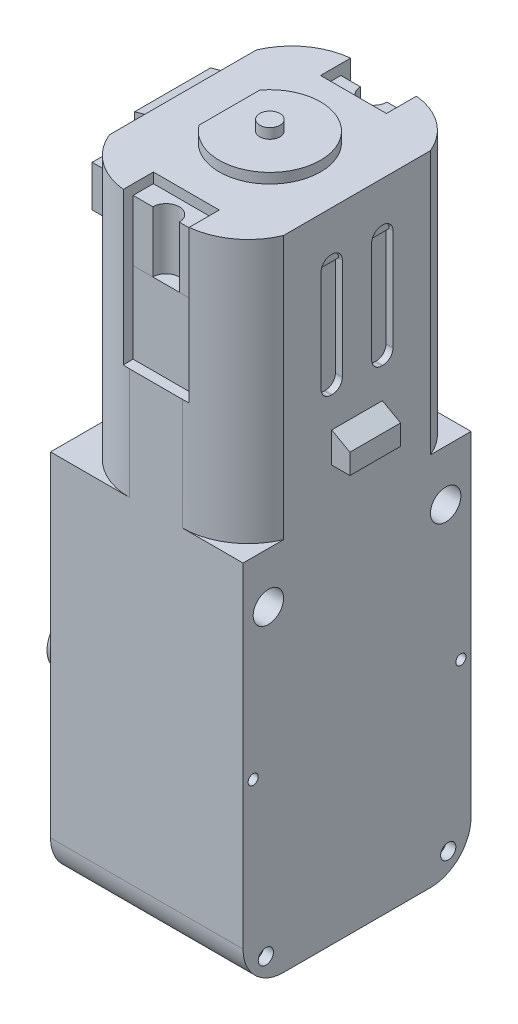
from build123d import *

# Parameters (mm, degrees)
SALIENTE_EXTRUIR2_DEPTH       = 9.5
SALIENTE_EXTRUIR2_DEPTH_BACK  = 9.5
SALIENTE_EXTRUIR4_DEPTH       = 1.3
SALIENTE_EXTRUIR4_DEPTH_BACK  = 1.3
CROQUIS2_W                    = 4.5
CROQUIS2_H                    = 5
CROQUIS2_R                    = 1.5
CROQUIS3_R                    = 2.5
CORTAR_EXTRUIR1_DEPTH         = 5
CROQUIS5_R                    = 0.75
CROQUIS5_R_2                  = 0.5
CORTAR_EXTRUIR2_DEPTH         = 1
CORTAR_EXTRUIR3_START         = -1
CROQUIS4_R                    = 0.5
CROQUIS4_R_2                  = 0.75
CORTAR_EXTRUIR3_DEPTH         = 1
CROQUIS6_R                    = 2
SALIENTE_EXTRUIR6_DEPTH       = 2
CROQUIS7_R                    = 1.5
CORTAR_EXTRUIR4_DEPTH         = 37.97672376
SALIENTE_EXTRUIR7_DEPTH       = 26
CROQUIS9_W                    = 27.483780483
CROQUIS9_H                    = 31.518144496
CORTAR_EXTRUIR5_DEPTH         = 60.879863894
CORTAR_EXTRUIR7_DEPTH         = 60.879863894
CORTAR_EXTRUIR7_DEPTH_BACK    = 60.879863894
CROQUIS11_W                   = 28.397068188
CROQUIS11_H                   = 15.296763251
CROQUIS12_W                   = 22.5
CROQUIS12_H                   = 4.565295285
CROQUIS12_R                   = 1.5
CORTAR_EXTRUIR8_DEPTH         = 60.879863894
CROQUIS14_W                   = 19
CROQUIS14_H                   = 22.5
SALIENTE_EXTRUIR9_DEPTH       = 30
CROQUIS15_R                   = 1.5
CORTAR_EXTRUIR9_DEPTH         = 60.879863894
CROQUIS16_R                   = 2
SALIENTE_EXTRUIR10_DEPTH      = 2
CROQUIS17_R                   = 0.5
CROQUIS17_R_2                 = 0.75
CORTAR_EXTRUIR10_DEPTH        = 60.879863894
CROQUIS20_W                   = 0.773109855
CROQUIS20_H                   = 0.470542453
SALIENTE_EXTRUIR12_DEPTH      = 24
CROQUIS21_W                   = 16.85701041
CROQUIS21_H                   = 22.5
SALIENTE_EXTRUIR13_DEPTH      = 24
CORTAR_EXTRUIR11_DEPTH        = 60.879863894
CORTAR_EXTRUIR12_DEPTH        = 5
CROQUIS23_R                   = 2.75
CROQUIS23_R_2                 = 2.6
SALIENTE_EXTRUIR14_DEPTH      = 0.5
SALIENTE_EXTRUIR14_DRAFT      = 8
CROQUIS24_W                   = 2.5
CROQUIS24_H                   = 5
SALIENTE_EXTRUIR15_DEPTH      = 4.7
CROQUIS25_R                   = 1.4
CORTAR_EXTRUIR13_DEPTH        = 4.7
SALIENTE_EXTRUIR17_DEPTH      = 2
SALIENTE_EXTRUIR17_DEPTH_BACK = 19
CROQUIS26_W                   = 3
CROQUIS26_H                   = 5
CORTAR_EXTRUIR14_DEPTH        = 58.938312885
CORTAR_EXTRUIR14_DEPTH_BACK   = 58.938312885
CORTAR_EXTRUIR15_DEPTH        = 60.879863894
CORTAR_EXTRUIR16_START        = -7
CORTAR_EXTRUIR16_DEPTH        = 7
SALIENTE_EXTRUIR18_DEPTH      = 3.75
SALIENTE_EXTRUIR18_DEPTH_BACK = 3.75
CROQUIS30_W                   = 7.5
CROQUIS30_H                   = 1
CORTAR_EXTRUIR17_DEPTH        = 58.938312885
CORTAR_EXTRUIR17_DEPTH_BACK   = 58.938312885
CROQUIS31_W                   = 5.5
CROQUIS31_H                   = 1.5
CORTAR_EXTRUIR18_DEPTH        = 58.938312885
CORTAR_EXTRUIR18_DEPTH_BACK   = 58.938312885
CORTAR_EXTRUIR22_DEPTH        = 59.781677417
CORTAR_EXTRUIR22_DEPTH_BACK   = 59.781677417
CORTAR_EXTRUIR23_START        = -15
CORTAR_EXTRUIR23_DEPTH        = 15
CORTAR_EXTRUIR24_DEPTH        = 5
CROQUIS37_W                   = 15.777972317
CROQUIS37_H                   = 14.808381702
SALIENTE_EXTRUIR19_DEPTH      = 11
CROQUIS38_W                   = 18.88083152
CROQUIS38_H                   = 4.081408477
SALIENTE_EXTRUIR21_DEPTH      = 1
CROQUIS39_W                   = 9.12350037
CROQUIS39_H                   = 4.081408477
SALIENTE_EXTRUIR23_DEPTH      = 0.6
CROQUIS40_W                   = 6.5
CROQUIS40_H                   = 2
SALIENTE_EXTRUIR24_DEPTH      = 8
SALIENTE_EXTRUIR24_2_DEPTH    = 8
CROQUIS41_R                   = 1
SALIENTE_EXTRUIR26_DEPTH      = 7
SALIENTE_EXTRUIR27_DEPTH      = 6
SALIENTE_EXTRUIR27_2_DEPTH    = 6
SALIENTE_EXTRUIR28_DEPTH      = 6
CROQUIS44_W                   = 5.21443522
CROQUIS44_H                   = 9.574781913
SALIENTE_EXTRUIR29_DEPTH      = 2
CROQUIS46_R                   = 0.697640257
SALIENTE_EXTRUIR32_DEPTH      = 0.4
SALIENTE_EXTRUIR32_2_DEPTH    = 0.4
CROQUIS47_R                   = 2.6
SALIENTE_EXTRUIR33_DEPTH      = 14
CORTAR_EXTRUIR25_DEPTH        = 8
CROQUIS49_R                   = 1
CORTAR_EXTRUIR26_DEPTH        = 8


with BuildPart() as part:
    # Croquis1 → Saliente-Extruir2 (new, two sides: drawn at the far end of the back side and taken through both)
    with BuildSketch(Plane.YZ.offset(-SALIENTE_EXTRUIR2_DEPTH_BACK)):
        with BuildLine():
            Line((-4.84, 11.25), (29.66, 11.25))
            Line((29.66, 11.25), (29.66, -11.25))
            Line((29.66, -11.25), (-4.84, -11.25))
            ThreePointArc((-4.84, -11.25), (-6.607766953, -10.517766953), (-7.34, -8.75))
            Line((-7.34, -8.75), (-7.34, 8.75))
            ThreePointArc((-7.34, 8.75), (-6.607766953, 10.517766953), (-4.84, 11.25))
        make_face()
    extrude(amount=SALIENTE_EXTRUIR2_DEPTH + SALIENTE_EXTRUIR2_DEPTH_BACK)

    # Croquis2 → Saliente-Extruir4 (add, two sides: drawn at the far end of the back side and taken through both)
    with BuildSketch(Plane.YZ.offset(-SALIENTE_EXTRUIR4_DEPTH_BACK)):
        with Locations((-9.59, 0)):
            Rectangle(CROQUIS2_W, CROQUIS2_H)
        with Locations(Location((-9.34, 0, 0), (0, 0, 270))):
            Circle(CROQUIS2_R, mode=Mode.SUBTRACT)
    extrude(amount=SALIENTE_EXTRUIR4_DEPTH + SALIENTE_EXTRUIR4_DEPTH_BACK)

    # Croquis3 → Cortar-Extruir1 (cut)
    with BuildSketch(Plane(origin=(-9.5, 0, 0), x_dir=(0, -1, 0), z_dir=(-1, 0, 0))):
        with Locations(Location((0, 0, 0), (0, 0, 90))):
            Circle(CROQUIS3_R)
    extrude(amount=-CORTAR_EXTRUIR1_DEPTH, mode=Mode.SUBTRACT)

    # Croquis5 → Cortar-Extruir2 (cut)
    with BuildSketch(Plane.YZ.offset(9.5)):
        with Locations(Location((-4.84, 8.75, 0), (0, 0, 270))):
            Circle(CROQUIS5_R)
        with Locations(Location((5.66, 9.75, 0), (0, 0, 270))):
            Circle(CROQUIS5_R_2)
        with Locations(Location((5.66, -9.75, 0), (0, 0, 270))):
            Circle(CROQUIS5_R_2)
        with Locations(Location((-4.84, -8.75, 0), (0, 0, 270))):
            Circle(CROQUIS5_R)
    extrude(amount=-CORTAR_EXTRUIR2_DEPTH, mode=Mode.SUBTRACT)

    # Croquis4 → Cortar-Extruir3 (cut)
    with BuildSketch(Plane.ZY.offset(9.5).offset(CORTAR_EXTRUIR3_START)):
        with Locations(Location((9.75, 5.66, 0), (0, 0, 180))):
            Circle(CROQUIS4_R)
        with Locations(Location((8.75, -4.84, 0), (0, 0, 180))):
            Circle(CROQUIS4_R_2)
        with Locations(Location((-8.75, -4.84, 0), (0, 0, 180))):
            Circle(CROQUIS4_R_2)
        with Locations(Location((-9.75, 5.66, 0), (0, 0, 180))):
            Circle(CROQUIS4_R)
    extrude(amount=CORTAR_EXTRUIR3_DEPTH, mode=Mode.SUBTRACT)

    # Croquis6 → Saliente-Extruir6 (add)
    with BuildSketch(Plane.ZY.offset(9.5)):
        with Locations(Location((0, 10.66, 0), (0, 0, 180))):
            Circle(CROQUIS6_R)
    extrude(amount=SALIENTE_EXTRUIR6_DEPTH)

    # Croquis7 → Cortar-Extruir4 (cut, through all)
    with BuildSketch(Plane.ZY.offset(9.5)):
        with Locations((-8.75, 19.66)):
            Circle(CROQUIS7_R)
        with Locations(Location((8.75, 19.66, 0), (0, 0, 180))):
            Circle(CROQUIS7_R)
    extrude(amount=-CORTAR_EXTRUIR4_DEPTH, mode=Mode.SUBTRACT)

    # Croquis8 → Saliente-Extruir7 (add)
    with BuildSketch(Plane(origin=(0, 29.66, 0), x_dir=(-1, 0, 0), z_dir=(0, 1, 0))):
        with BuildLine():
            Line((-3.5, 11.25), (1.7, 11.25))
            ThreePointArc((1.7, 11.25), (5.305551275, 10.158326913), (7.7, 7.25))
            Line((7.7, 7.25), (7.7, -7.25))
            ThreePointArc((7.7, -7.25), (5.305551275, -10.158326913), (1.7, -11.25))
            Line((1.7, -11.25), (-3.5, -11.25))
            ThreePointArc((-3.5, -11.25), (-7.105551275, -10.158326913), (-9.5, -7.25))
            Line((-9.5, -7.25), (-9.5, 7.25))
            ThreePointArc((-9.5, 7.25), (-7.105551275, 10.158326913), (-3.5, 11.25))
        make_face()
    extrude(amount=SALIENTE_EXTRUIR7_DEPTH)

    # Croquis9 → Cortar-Extruir5 (cut, through all)
    with BuildSketch(Plane(origin=(-9.5, 0, 0), x_dir=(0, -1, 0), z_dir=(-1, 0, 0))):
        with Locations((5.081890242, -0.401551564)):
            Rectangle(CROQUIS9_W, CROQUIS9_H)
    extrude(amount=-CORTAR_EXTRUIR5_DEPTH, mode=Mode.SUBTRACT)

    # Croquis11 → Cortar-Extruir7 (cut, two sides: drawn at the far end of the back side and taken through both)
    with BuildSketch(Plane.ZY.offset(9.5).offset(-CORTAR_EXTRUIR7_DEPTH_BACK)):
        with Locations((-0.835139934, 10.44632309)):
            Rectangle(CROQUIS11_W, CROQUIS11_H)
    extrude(amount=CORTAR_EXTRUIR7_DEPTH + CORTAR_EXTRUIR7_DEPTH_BACK, mode=Mode.SUBTRACT)

    # Croquis12 → Cortar-Extruir8 (cut, through all)
    # profile 1 of 2: a face of its own
    with BuildSketch(Plane.ZY.offset(9.5)):
        with Locations((0, 20.377352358)):
            Rectangle(CROQUIS12_W, CROQUIS12_H)
        with Locations((-8.75, 19.66)):
            Circle(CROQUIS12_R, mode=Mode.SUBTRACT)
        with Locations((8.75, 19.66)):
            Circle(CROQUIS12_R, mode=Mode.SUBTRACT)
    # profile 2 of 2: a face of its own
    with BuildSketch(Plane.ZY.offset(9.5)):
        Polygon((12.104698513, 22.66), (11.25, 22.66), (11.25, 18.094704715), (-11.25, 18.094704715), (-11.25, 15.490950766), (12.104698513, 15.490950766), align=None)
    extrude(amount=-CORTAR_EXTRUIR8_DEPTH, mode=Mode.SUBTRACT)

    # Croquis14 → Saliente-Extruir9 (add)
    with BuildSketch(Plane(origin=(0, 22.66, 0), x_dir=(-1, 0, 0), z_dir=(0, -1, 0))):
        Rectangle(CROQUIS14_W, CROQUIS14_H)
    extrude(amount=SALIENTE_EXTRUIR9_DEPTH)

    # Croquis15 → Cortar-Extruir9 (cut, through all)
    with BuildSketch(Plane.ZY.offset(9.5)):
        with Locations((8.75, 24.66)):
            Circle(CROQUIS15_R)
        with Locations((-8.75, 24.66)):
            Circle(CROQUIS15_R)
    extrude(amount=-CORTAR_EXTRUIR9_DEPTH, mode=Mode.SUBTRACT)

    # Croquis16 → Saliente-Extruir10 (add)
    with BuildSketch(Plane.ZY.offset(9.5)):
        with Locations(Location((0, 15.66, 0), (0, 0, 180))):
            Circle(CROQUIS16_R)
    extrude(amount=SALIENTE_EXTRUIR10_DEPTH)

    # Croquis17 → Cortar-Extruir10 (cut, through all)
    with BuildSketch(Plane.ZY.offset(9.5)):
        with Locations((10.25, 10.66)):
            Circle(CROQUIS17_R)
        with BuildLine():
            ThreePointArc((9.530330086, -5.620330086), (9.692909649, -5.377012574), (9.75, -5.09))
            ThreePointArc((9.75, -5.09), (9.287012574, -4.397090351), (8.469669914, -4.559669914))
            Line((8.469669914, -4.559669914), (9.530330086, -5.620330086))
        make_face()
        with BuildLine():
            Line((9.530330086, -5.620330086), (8.469669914, -4.559669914))
            ThreePointArc((8.469669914, -4.559669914), (8.469669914, -5.620330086), (9.530330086, -5.620330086))
        make_face()
        with BuildLine():
            ThreePointArc((9.530330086, -5.620330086), (9.692909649, -5.377012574), (9.75, -5.09))
            ThreePointArc((9.75, -5.09), (9.287012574, -4.397090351), (8.469669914, -4.559669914))
            Line((8.469669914, -4.559669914), (9.530330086, -5.620330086))
        make_face()
        with BuildLine():
            Line((9.530330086, -5.620330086), (8.469669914, -4.559669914))
            ThreePointArc((8.469669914, -4.559669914), (8.469669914, -5.620330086), (9.530330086, -5.620330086))
        make_face()
        with Locations((-10.25, 10.66)):
            Circle(CROQUIS17_R)
        with Locations(Location((-9, -5.09, 0), (0, 0, 180))):
            Circle(CROQUIS17_R_2)
    extrude(amount=-CORTAR_EXTRUIR10_DEPTH, mode=Mode.SUBTRACT)

    # Croquis20 → Saliente-Extruir12 (add)
    with BuildSketch(Plane.XZ.offset(7.34)):
        with Locations((2.429452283, 4.566914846)):
            Rectangle(CROQUIS20_W, CROQUIS20_H)
    extrude(amount=-SALIENTE_EXTRUIR12_DEPTH)

    # Croquis21 → Saliente-Extruir13 (add)
    with BuildSketch(Plane(origin=(0, -7.34, 0), x_dir=(-1, 0, 0), z_dir=(0, -1, 0))):
        with Locations((-0.10132468, 0)):
            Rectangle(CROQUIS21_W, CROQUIS21_H)
    extrude(amount=-SALIENTE_EXTRUIR13_DEPTH)

    # Croquis19 → Cortar-Extruir11 (cut, through all)
    with BuildSketch(Plane.ZY.offset(9.5)):
        with BuildLine():
            Line((7.25, -7.34), (11.25, -7.34))
            Line((11.25, -7.34), (11.25, -3.34))
            ThreePointArc((11.25, -3.34), (10.078427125, -6.168427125), (7.25, -7.34))
        make_face()
        with BuildLine():
            Line((-11.25, -7.34), (-7.25, -7.34))
            ThreePointArc((-7.25, -7.34), (-10.078427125, -6.168427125), (-11.25, -3.34))
            Line((-11.25, -3.34), (-11.25, -7.34))
        make_face()
    extrude(amount=-CORTAR_EXTRUIR11_DEPTH, mode=Mode.SUBTRACT)

    # Croquis22 → Cortar-Extruir12 (cut)
    with BuildSketch(Plane.ZY.offset(9.5)):
        with BuildLine():
            ThreePointArc((-2.6, 3.86), (0, 1.26), (2.6, 3.86))
            Line((2.6, 3.86), (-2.6, 3.86))
        make_face()
        with BuildLine():
            Line((-2.6, 3.86), (2.6, 3.86))
            ThreePointArc((2.6, 3.86), (0, 6.46), (-2.6, 3.86))
        make_face()
        with BuildLine():
            ThreePointArc((-2.6, 3.86), (0, 1.26), (2.6, 3.86))
            Line((2.6, 3.86), (-2.6, 3.86))
        make_face()
        with BuildLine():
            Line((-2.6, 3.86), (2.6, 3.86))
            ThreePointArc((2.6, 3.86), (0, 6.46), (-2.6, 3.86))
        make_face()
    extrude(amount=-CORTAR_EXTRUIR12_DEPTH, mode=Mode.SUBTRACT)


with BuildPart() as saliente_extruir14_tool:
    # Croquis23 → Saliente-Extruir14 (with draft: the straight prism first)
    with BuildSketch(Plane.ZY.offset(9.5)):
        with Locations((0, 3.86)):
            Circle(CROQUIS23_R)
        with Locations((0, 3.86)):
            Circle(CROQUIS23_R_2, mode=Mode.SUBTRACT)
    extrude(amount=SALIENTE_EXTRUIR14_DEPTH)
    # Saliente-Extruir14: the draft: its side faces are tilted about the plane it starts from
    saliente_extruir14_sides = [saliente_extruir14_tool.faces().sort_by_distance(p)[0] for p in [
        (-9.75, 3.86, -2.75),
        (-9.75, 3.86, -2.6),
    ]]
    draft(saliente_extruir14_sides, Plane.ZY.offset(9.5), SALIENTE_EXTRUIR14_DRAFT)


with BuildPart() as part_1:
    add(part.part)

    # Saliente-Extruir14: add saliente_extruir14_tool
    add(saliente_extruir14_tool.part)

    # Croquis24 → Saliente-Extruir15 (add)
    with BuildSketch(Plane.XZ.offset(7.34)):
        Rectangle(CROQUIS24_W, CROQUIS24_H)
    extrude(amount=SALIENTE_EXTRUIR15_DEPTH)

    # Croquis25 → Cortar-Extruir13 (cut)
    with BuildSketch(Plane.ZY.offset(1.25)):
        with Locations((0, -9.64)):
            Circle(CROQUIS25_R)
    extrude(amount=-CORTAR_EXTRUIR13_DEPTH, mode=Mode.SUBTRACT)

    # Croquis26 → Saliente-Extruir17 (add, two sides: drawn at the far end of the back side and taken through both)
    with BuildSketch(Plane(origin=(-7.7, 0, 0), x_dir=(0, -1, 0), z_dir=(-1, 0, 0)).offset(-SALIENTE_EXTRUIR17_DEPTH_BACK)):
        with Locations((-35.16, 0)):
            Rectangle(CROQUIS26_W, CROQUIS26_H)
    extrude(amount=SALIENTE_EXTRUIR17_DEPTH + SALIENTE_EXTRUIR17_DEPTH_BACK)

    # Croquis27 → Cortar-Extruir14 (cut, two sides: drawn at the far end of the back side and taken through both)
    with BuildSketch(Plane(origin=(0, 0, 0), x_dir=(0, 1, 0), z_dir=(0, 0, 1)).offset(-CORTAR_EXTRUIR14_DEPTH_BACK)):
        Polygon((36.66, 7.7), (36.66, 9.7), (35.66, 9.7), align=None)
        Polygon((36.66, -11.3), (35.66, -11.3), (36.66, -9.5), align=None)
    extrude(amount=CORTAR_EXTRUIR14_DEPTH + CORTAR_EXTRUIR14_DEPTH_BACK, mode=Mode.SUBTRACT)

    # Croquis28 → Cortar-Extruir15 (cut, through all)
    with BuildSketch(Plane(origin=(-7.7, 0, 0), x_dir=(0, -1, 0), z_dir=(-1, 0, 0))):
        with BuildLine():
            Line((-46.66, 2.446465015), (-46.66, 2.553534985))
            ThreePointArc((-46.66, 2.553534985), (-46.367106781, 3.260641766), (-45.66, 3.553534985))
            Line((-45.66, 3.553534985), (-40.66, 3.553534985))
            ThreePointArc((-40.66, 3.553534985), (-39.952893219, 3.260641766), (-39.66, 2.553534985))
            Line((-39.66, 2.553534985), (-39.66, 2.446465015))
            ThreePointArc((-39.66, 2.446465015), (-39.952893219, 1.739358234), (-40.66, 1.446465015))
            Line((-40.66, 1.446465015), (-45.66, 1.446465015))
            ThreePointArc((-45.66, 1.446465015), (-46.367106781, 1.739358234), (-46.66, 2.446465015))
        make_face()
        with BuildLine():
            Line((-45.66, -1.446465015), (-40.66, -1.446465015))
            ThreePointArc((-40.66, -1.446465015), (-39.952893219, -1.739358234), (-39.66, -2.446465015))
            Line((-39.66, -2.446465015), (-39.66, -2.553534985))
            ThreePointArc((-39.66, -2.553534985), (-39.952893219, -3.260641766), (-40.66, -3.553534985))
            Line((-40.66, -3.553534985), (-45.66, -3.553534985))
            ThreePointArc((-45.66, -3.553534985), (-46.367106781, -3.260641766), (-46.66, -2.553534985))
            Line((-46.66, -2.553534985), (-46.66, -2.446465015))
            ThreePointArc((-46.66, -2.446465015), (-46.367106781, -1.739358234), (-45.66, -1.446465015))
        make_face()
    extrude(amount=-CORTAR_EXTRUIR15_DEPTH, mode=Mode.SUBTRACT)

    # Croquis29 → Cortar-Extruir16 (cut)
    with BuildSketch(Plane.YZ.offset(9.5).offset(CORTAR_EXTRUIR16_START)):
        with BuildLine():
            Line((50.66, 3.553534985), (45.66, 3.553534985))
            ThreePointArc((45.66, 3.553534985), (46.367106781, 3.260641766), (46.66, 2.553534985))
            Line((46.66, 2.553534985), (46.66, 2.446465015))
            ThreePointArc((46.66, 2.446465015), (46.367106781, 1.739358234), (45.66, 1.446465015))
            Line((45.66, 1.446465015), (50.66, 1.446465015))
            ThreePointArc((50.66, 1.446465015), (51.367106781, 1.739358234), (51.66, 2.446465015))
            Line((51.66, 2.446465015), (51.66, 2.553534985))
            ThreePointArc((51.66, 2.553534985), (51.367106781, 3.260641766), (50.66, 3.553534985))
        make_face()
        with BuildLine():
            Line((50.66, -1.446465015), (45.66, -1.446465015))
            ThreePointArc((45.66, -1.446465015), (46.367106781, -1.739358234), (46.66, -2.446465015))
            Line((46.66, -2.446465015), (46.66, -2.553534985))
            ThreePointArc((46.66, -2.553534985), (46.367106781, -3.260641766), (45.66, -3.553534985))
            Line((45.66, -3.553534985), (50.66, -3.553534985))
            ThreePointArc((50.66, -3.553534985), (51.367106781, -3.260641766), (51.66, -2.553534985))
            Line((51.66, -2.553534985), (51.66, -2.446465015))
            ThreePointArc((51.66, -2.446465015), (51.367106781, -1.739358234), (50.66, -1.446465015))
        make_face()
    extrude(amount=CORTAR_EXTRUIR16_DEPTH, mode=Mode.SUBTRACT)

    # Croquis30 → Saliente-Extruir18 (add, two sides: drawn at the far end of the back side and taken through both)
    with BuildSketch(Plane(origin=(0, 0, 0), x_dir=(0, 1, 0), z_dir=(0, 0, 1)).offset(-SALIENTE_EXTRUIR18_DEPTH_BACK)):
        with Locations((51.91, 8.2)):
            Rectangle(CROQUIS30_W, CROQUIS30_H)
    extrude(amount=SALIENTE_EXTRUIR18_DEPTH + SALIENTE_EXTRUIR18_DEPTH_BACK)

    # Croquis31 → Cortar-Extruir17 (cut, two sides: drawn at the far end of the back side and taken through both)
    with BuildSketch(Plane(origin=(0, 0, 0), x_dir=(0, 1, 0), z_dir=(0, 0, 1)).offset(-CORTAR_EXTRUIR17_DEPTH_BACK)):
        with Locations((51.91, 6.95)):
            Rectangle(CROQUIS31_W, CROQUIS31_H)
    extrude(amount=CORTAR_EXTRUIR17_DEPTH + CORTAR_EXTRUIR17_DEPTH_BACK, mode=Mode.SUBTRACT)

    # Croquis32 → Cortar-Extruir18 (cut, two sides: drawn at the far end of the back side and taken through both)
    with BuildSketch(Plane(origin=(0, 0, 0), x_dir=(0, 1, 0), z_dir=(0, 0, 1)).offset(-CORTAR_EXTRUIR18_DEPTH_BACK)):
        Polygon((48.16, 7.7), (48.16, 8.7), (48.926036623, 8.7), align=None)
    extrude(amount=CORTAR_EXTRUIR18_DEPTH + CORTAR_EXTRUIR18_DEPTH_BACK, mode=Mode.SUBTRACT)

    # Croquis33 → Cortar-Extruir22 (cut, two sides: drawn at the far end of the back side and taken through both)
    with BuildSketch(Plane.XY.offset(3.75).offset(-CORTAR_EXTRUIR22_DEPTH_BACK)):
        Polygon((-8.7, 55.386723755), (-7.7, 55.66), (-8.7, 55.66), align=None)
    extrude(amount=CORTAR_EXTRUIR22_DEPTH + CORTAR_EXTRUIR22_DEPTH_BACK, mode=Mode.SUBTRACT)

    # Croquis34 → Cortar-Extruir23 (cut)
    with BuildSketch(Plane(origin=(0, 55.66, 0), x_dir=(1, 0, 0), z_dir=(0, 1, 0)).offset(CORTAR_EXTRUIR23_START)):
        with BuildLine():
            Line((0.9, -11.25), (3.5, -11.25))
            ThreePointArc((3.5, -11.25), (3.825408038, -11.241849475), (4.15, -11.217418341))
            Line((4.15, -11.217418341), (4.15, -8.25))
            Line((4.15, -8.25), (-2.35, -8.25))
            Line((-2.35, -8.25), (-2.35, -11.217418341))
            ThreePointArc((-2.35, -11.217418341), (-2.025408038, -11.241849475), (-1.7, -11.25))
            Line((-1.7, -11.25), (0.9, -11.25))
        make_face()
        with BuildLine():
            ThreePointArc((4.15, 11.217418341), (3.825408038, 11.241849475), (3.5, 11.25))
            Line((3.5, 11.25), (-1.7, 11.25))
            ThreePointArc((-1.7, 11.25), (-2.025408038, 11.241849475), (-2.35, 11.217418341))
            Line((-2.35, 11.217418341), (-2.35, 8.25))
            Line((-2.35, 8.25), (4.15, 8.25))
            Line((4.15, 8.25), (4.15, 11.217418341))
        make_face()
    extrude(amount=CORTAR_EXTRUIR23_DEPTH, mode=Mode.SUBTRACT)

    # Croquis35 → Cortar-Extruir24 (cut)
    with BuildSketch(Plane(origin=(0, 55.66, 0), x_dir=(-1, 0, 0), z_dir=(0, 1, 0))):
        with BuildLine():
            ThreePointArc((3.1, 3), (-2.48113883, 4.74341649), (-5.9, 0))
            Line((-5.9, 0), (3.1, 0))
            Line((3.1, 0), (3.1, 3))
        make_face()
        with BuildLine():
            ThreePointArc((3.1, 3), (-2.48113883, 4.74341649), (-5.9, 0))
            Line((-5.9, 0), (3.1, 0))
            Line((3.1, 0), (3.1, 3))
        make_face()
        with BuildLine():
            Line((3.1, 0), (-5.9, 0))
            ThreePointArc((-5.9, 0), (-2.48113883, -4.74341649), (3.1, -3))
            Line((3.1, -3), (3.1, 0))
        make_face()
    extrude(amount=-CORTAR_EXTRUIR24_DEPTH, mode=Mode.SUBTRACT)


with BuildPart() as body_2:
    # Croquis37 → Saliente-Extruir19 (new body)
    with BuildSketch(Plane(origin=(0, 39.66, 0), x_dir=(1, 0, 0), z_dir=(0, 1, 0))):
        with Locations((0.922815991, 0.584105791)):
            Rectangle(CROQUIS37_W, CROQUIS37_H)
    extrude(amount=SALIENTE_EXTRUIR19_DEPTH)


with BuildPart() as body_3:
    # Croquis38 → Saliente-Extruir21 (new body)
    with BuildSketch(Plane.ZY.offset(6.2)):
        with Locations((0, 52.619295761)):
            Rectangle(CROQUIS38_W, CROQUIS38_H)
    extrude(amount=SALIENTE_EXTRUIR21_DEPTH)


with BuildPart() as body_4:
    # Croquis39 → Saliente-Extruir23 (new body)
    with BuildSketch(Plane.ZY.offset(7.2)):
        with Locations((-0.017583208, 52.619295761)):
            Rectangle(CROQUIS39_W, CROQUIS39_H)
    extrude(amount=SALIENTE_EXTRUIR23_DEPTH)


with BuildPart() as body_5:
    # Croquis40 → Saliente-Extruir24 (new body)
    with BuildSketch(Plane(origin=(0, 40.66, 0), x_dir=(-1, 0, 0), z_dir=(0, 1, 0))):
        with Locations((-0.9, 9.25)):
            Rectangle(CROQUIS40_W, CROQUIS40_H)
    extrude(amount=SALIENTE_EXTRUIR24_DEPTH)


with BuildPart() as body_6:
    # Croquis40 → Saliente-Extruir24 2 (new body)
    with BuildSketch(Plane(origin=(0, 40.66, 0), x_dir=(-1, 0, 0), z_dir=(0, 1, 0))):
        with Locations((-0.9, -9.25)):
            Rectangle(CROQUIS40_W, CROQUIS40_H)
    extrude(amount=SALIENTE_EXTRUIR24_2_DEPTH)


with BuildPart() as body_7:
    # Croquis41 → Saliente-Extruir26 (new body)
    with BuildSketch(Plane(origin=(0, 50.66, 0), x_dir=(1, 0, 0), z_dir=(0, 1, 0))):
        with Locations(Location((0.9, 0, 0), (0, 0, 270))):
            Circle(CROQUIS41_R)
    extrude(amount=SALIENTE_EXTRUIR26_DEPTH)


with BuildPart() as body_8:
    # Croquis42 → Saliente-Extruir27 (new body)
    with BuildSketch(Plane(origin=(0, 48.66, 0), x_dir=(1, 0, 0), z_dir=(0, 1, 0))):
        with BuildLine():
            Line((4.15, -8.25), (-2.35, -8.25))
            Line((-2.35, -8.25), (-2.35, -10.25))
            Line((-2.35, -10.25), (-0.405896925, -10.25))
            ThreePointArc((-0.405896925, -10.25), (0.9, -8.944103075), (2.205896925, -10.25))
            Line((2.205896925, -10.25), (4.15, -10.25))
            Line((4.15, -10.25), (4.15, -8.25))
        make_face()
    extrude(amount=SALIENTE_EXTRUIR27_DEPTH)


with BuildPart() as body_9:
    # Croquis42 → Saliente-Extruir27 2 (new body)
    with BuildSketch(Plane(origin=(0, 48.66, 0), x_dir=(1, 0, 0), z_dir=(0, 1, 0))):
        with BuildLine():
            Line((2.205896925, 10.25), (4.15, 10.25))
            Line((4.15, 10.25), (4.15, 8.25))
            Line((4.15, 8.25), (-2.35, 8.25))
            Line((-2.35, 8.25), (-2.35, 10.25))
            Line((-2.35, 10.25), (-0.405896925, 10.25))
            ThreePointArc((-0.405896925, 10.25), (0.9, 8.944103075), (2.205896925, 10.25))
        make_face()
    extrude(amount=SALIENTE_EXTRUIR27_2_DEPTH)


with BuildPart() as body_10:
    # Croquis43 → Saliente-Extruir28 (new body)
    with BuildSketch(Plane(origin=(0, 50.66, 0), x_dir=(1, 0, 0), z_dir=(0, 1, 0))):
        with BuildLine():
            Line((-3.1, -3), (-3.1, 3))
            ThreePointArc((-3.1, 3), (5.9, 0), (-3.1, -3))
        make_face()
    extrude(amount=SALIENTE_EXTRUIR28_DEPTH)


with BuildPart() as body_11:
    # Croquis44 → Saliente-Extruir29 (new body)
    with BuildSketch(Plane(origin=(0, 50.66, 0), x_dir=(1, 0, 0), z_dir=(0, 1, 0))):
        with Locations((6.50794808, -0.067428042)):
            Rectangle(CROQUIS44_W, CROQUIS44_H)
    extrude(amount=SALIENTE_EXTRUIR29_DEPTH)


with BuildPart() as body_12:
    # Croquis46 → Saliente-Extruir32 (new body)
    with BuildSketch(Plane.ZY.offset(7.2)):
        with BuildLine():
            ThreePointArc((7.197491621, 53.779002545), (7.904598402, 53.486109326), (8.197491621, 52.779002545))
            Line((8.197491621, 52.779002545), (8.197491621, 52.459588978))
            ThreePointArc((8.197491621, 52.459588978), (7.904598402, 51.752482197), (7.197491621, 51.459588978))
            Line((7.197491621, 51.459588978), (4.544166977, 51.459588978))
            Line((4.544166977, 51.459588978), (4.544166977, 53.779002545))
            Line((4.544166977, 53.779002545), (7.197491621, 53.779002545))
        make_face()
        with Locations((7.197491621, 52.619295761)):
            Circle(CROQUIS46_R, mode=Mode.SUBTRACT)
    extrude(amount=SALIENTE_EXTRUIR32_DEPTH)


with BuildPart() as body_13:
    # Croquis46 → Saliente-Extruir32 2 (new body)
    with BuildSketch(Plane.ZY.offset(7.2)):
        with BuildLine():
            Line((-4.544166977, 53.779002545), (-7.197491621, 53.779002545))
            ThreePointArc((-7.197491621, 53.779002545), (-7.904598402, 53.486109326), (-8.197491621, 52.779002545))
            Line((-8.197491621, 52.779002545), (-8.197491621, 52.459588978))
            ThreePointArc((-8.197491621, 52.459588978), (-7.904598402, 51.752482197), (-7.197491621, 51.459588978))
            Line((-7.197491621, 51.459588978), (-4.544166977, 51.459588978))
            Line((-4.544166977, 51.459588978), (-4.544166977, 53.779002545))
        make_face()
        with Locations((-7.197491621, 52.619295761)):
            Circle(CROQUIS46_R, mode=Mode.SUBTRACT)
    extrude(amount=SALIENTE_EXTRUIR32_2_DEPTH)


with BuildPart() as body_14:
    # Croquis47 → Saliente-Extruir33 (new body)
    with BuildSketch(Plane.ZY.offset(4.5)):
        with Locations((0, 3.86)):
            Circle(CROQUIS47_R)
    extrude(amount=SALIENTE_EXTRUIR33_DEPTH)

    # Croquis48 → Cortar-Extruir25 (cut)
    with BuildSketch(Plane.ZY.offset(18.5)):
        with BuildLine():
            Line((-1.922888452, 5.61), (0, 5.61))
            Line((0, 5.61), (1.922888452, 5.61))
            ThreePointArc((1.922888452, 5.61), (0, 6.46), (-1.922888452, 5.61))
        make_face()
        with BuildLine():
            Line((1.922888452, 2.11), (0, 2.11))
            Line((0, 2.11), (-1.922888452, 2.11))
            ThreePointArc((-1.922888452, 2.11), (0, 1.26), (1.922888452, 2.11))
        make_face()
    extrude(amount=-CORTAR_EXTRUIR25_DEPTH, mode=Mode.SUBTRACT)

    # Croquis49 → Cortar-Extruir26 (cut)
    with BuildSketch(Plane.ZY.offset(18.5)):
        with Locations((0, 3.86)):
            Circle(CROQUIS49_R)
    extrude(amount=-CORTAR_EXTRUIR26_DEPTH, mode=Mode.SUBTRACT)


solid = Compound([part_1.part, body_2.part, body_3.part, body_4.part, body_5.part, body_6.part, body_7.part, body_8.part, body_9.part, body_10.part, body_11.part, body_12.part, body_13.part, body_14.part])
